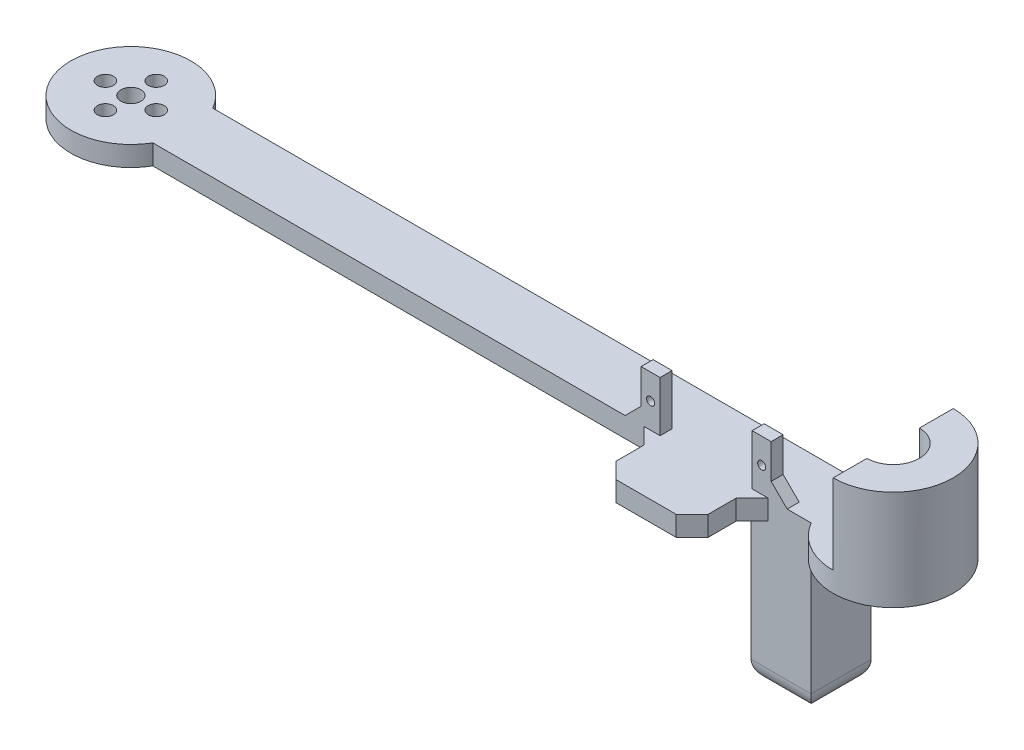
from build123d import *

# Parameters (mm, degrees)
SKETCH1_W           = 190.5
SKETCH1_H           = 15
BOSS_EXTRUDE1_DEPTH = 5
SKETCH2_R           = 15
BOSS_EXTRUDE2_DEPTH = 5
SKETCH4_R           = 2.5
SKETCH4_R_2         = 6.55
CUT_EXTRUDE1_DEPTH  = 207.788539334
SKETCH5_W           = 4.75
SKETCH5_H           = 3
BOSS_EXTRUDE3_DEPTH = 12.6
SKETCH7_R           = 1
CUT_EXTRUDE2_DEPTH  = 12.6
SKETCH8_W           = 23
SKETCH8_H           = 5
BOSS_EXTRUDE4_DEPTH = 15
BOSS_EXTRUDE5_START = 20
BOSS_EXTRUDE5_DEPTH = 20
SKETCH10_W          = 15
SKETCH10_H          = 15
BOSS_EXTRUDE6_DEPTH = 37
FILLET3_R           = 5
SKETCH11_R          = 2
CUT_EXTRUDE3_DEPTH  = 47
CHAMFER1_SIZE       = 4


with BuildPart() as part:
    # Sketch1 → Boss-Extrude1 (new body)
    with BuildSketch(Plane(origin=(0, 0, 0), x_dir=(1, 0, 0), z_dir=(0, 1, 0))):
        with Locations((95.25, 7.5)):
            Rectangle(SKETCH1_W, SKETCH1_H)
    extrude(amount=BOSS_EXTRUDE1_DEPTH)

    # Sketch2 → Boss-Extrude2 (add)
    with BuildSketch(Plane(origin=(0, 5, 0), x_dir=(1, 0, 0), z_dir=(0, 1, 0))):
        with Locations((190.5, 7.5)):
            Circle(SKETCH2_R)
        with Locations((0, 7.5)):
            Circle(SKETCH2_R)
    extrude(amount=-BOSS_EXTRUDE2_DEPTH)

    # Sketch4 → Cut-Extrude1 (cut, through all)
    with BuildSketch(Plane(origin=(0, 5, 0), x_dir=(1, 0, 0), z_dir=(0, 1, 0))):
        with Locations(Location((0, 7.5, 0), (0, 0, 270))):
            Circle(SKETCH4_R)
        with Locations(Location((190.5, 7.5, 0), (0, 0, 270))):
            Circle(SKETCH4_R_2)
    extrude(amount=-CUT_EXTRUDE1_DEPTH, mode=Mode.SUBTRACT)

    # Sketch5 → Boss-Extrude3 (add)
    with BuildSketch(Plane(origin=(0, 5, 0), x_dir=(1, 0, 0), z_dir=(0, 1, 0))):
        with Locations((137.384618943, 1.5)):
            Rectangle(SKETCH5_W, SKETCH5_H)
        with Locations((165.134618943, 1.5)):
            Rectangle(SKETCH5_W, SKETCH5_H)
    extrude(amount=BOSS_EXTRUDE3_DEPTH)

    # Sketch7 → Cut-Extrude2 (cut)
    with BuildSketch(Plane.XY):
        with Locations((137.384618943, 11.3)):
            Circle(SKETCH7_R)
        with Locations((165.134618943, 11.3)):
            Circle(SKETCH7_R)
    extrude(amount=-CUT_EXTRUDE2_DEPTH, mode=Mode.SUBTRACT)

    # Sketch8 → Boss-Extrude4 (add)
    with BuildSketch(Plane.XY):
        with Locations((151.259618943, 2.5)):
            Rectangle(SKETCH8_W, SKETCH8_H)
    extrude(amount=BOSS_EXTRUDE4_DEPTH)

    # Sketch9 → Boss-Extrude5 (add)
    with BuildSketch(Plane(origin=(0, 5, 0), x_dir=(1, 0, 0), z_dir=(0, 1, 0)).offset(BOSS_EXTRUDE5_START)):
        with BuildLine():
            Line((190.5, 22.5), (190.5, 14.05))
            ThreePointArc((190.5, 14.05), (195.131549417, 12.131549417), (197.05, 7.5))
            ThreePointArc((197.05, 7.5), (195.131549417, 2.868450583), (190.5, 0.95))
            Line((190.5, 0.95), (190.5, -7.5))
            ThreePointArc((190.5, -7.5), (205.5, 7.5), (190.5, 22.5))
        make_face()
    extrude(amount=-BOSS_EXTRUDE5_DEPTH)

    # Sketch10 → Boss-Extrude6 (add)
    with BuildSketch(Plane.XZ):
        with Locations((170.009618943, -7.5)):
            Rectangle(SKETCH10_W, SKETCH10_H)
    extrude(amount=BOSS_EXTRUDE6_DEPTH)

    # Fillet3
    fillet3_edges = [part.edges().sort_by_distance(p)[0] for p in [
        (177.509618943, -37, -7.5),
        (170.009618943, -37, 0),
        (162.509618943, -37, -7.5),
        (170.009618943, -37, -15),
    ]]
    fillet(fillet3_edges, radius=FILLET3_R)

    # Sketch11 → Cut-Extrude3 (cut)
    with BuildSketch(Plane(origin=(0, 5, 0), x_dir=(1, 0, 0), z_dir=(0, 1, 0))):
        with Locations(Location((0, 13.85, 0), (0, 0, 270))):
            Circle(SKETCH11_R)
        with Locations(Location((6.35, 7.5, 0), (0, 0, 270))):
            Circle(SKETCH11_R)
        with Locations(Location((0, 1.15, 0), (0, 0, 270))):
            Circle(SKETCH11_R)
        with Locations(Location((-6.35, 7.5, 0), (0, 0, 270))):
            Circle(SKETCH11_R)
    extrude(amount=-CUT_EXTRUDE3_DEPTH, mode=Mode.SUBTRACT)

    # Chamfer1
    chamfer1_edges = [part.edges().sort_by_distance(p)[0] for p in [
        (135.009618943, 5, -1.5),
        (167.509618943, 5, -1.5),
        (139.759618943, 2.5, 0),
        (162.759618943, 2.5, 0),
        (139.759618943, 2.5, 15),
        (162.759618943, 2.5, 15),
    ]]
    chamfer(chamfer1_edges, length=CHAMFER1_SIZE)


solid = part.part
